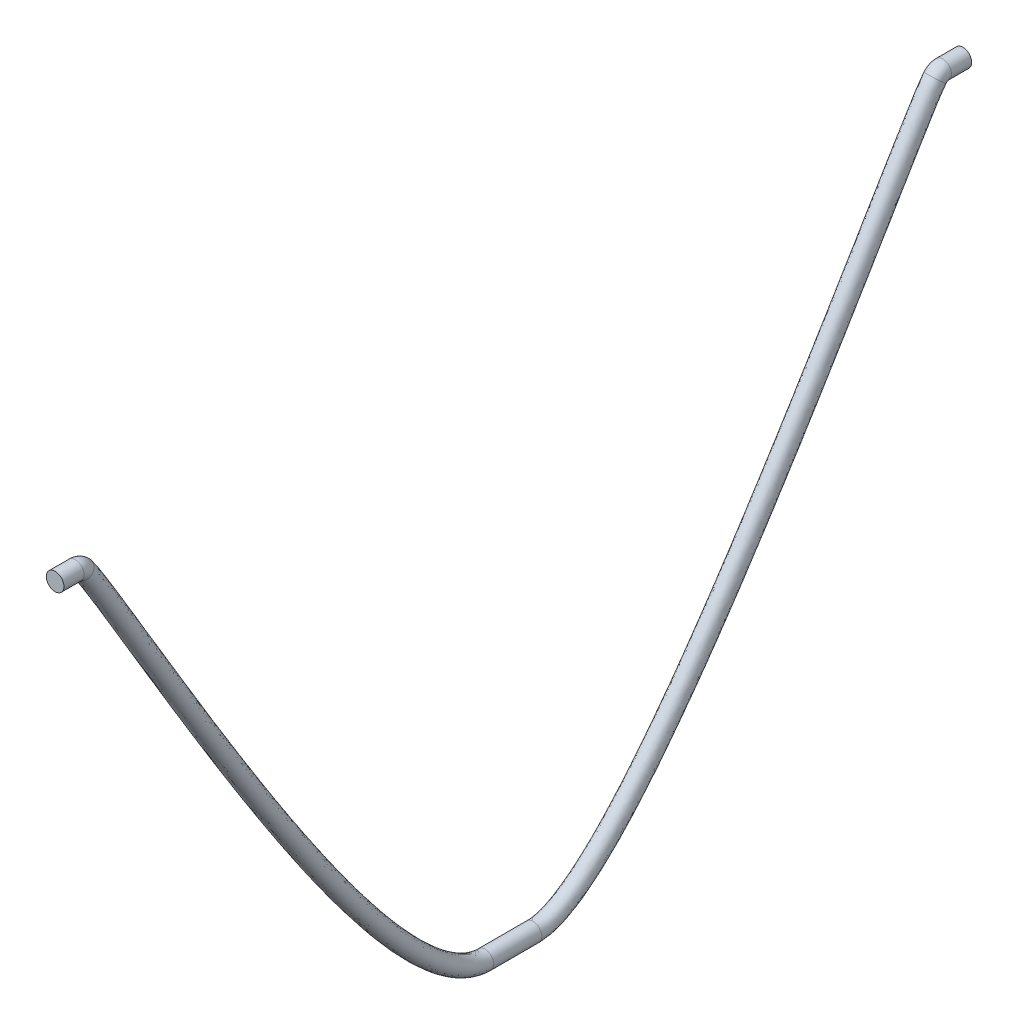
ISO-10303-21;
HEADER;
FILE_DESCRIPTION(('STEP AP214'),'2;1');
FILE_NAME('part.step','',(''),(''),'','','');
FILE_SCHEMA(('AUTOMOTIVE_DESIGN { 1 0 10303 214 1 1 1 1 }'));
ENDSEC;
DATA;
#1=APPLICATION_CONTEXT('core data for automotive mechanical design processes');
#2=APPLICATION_PROTOCOL_DEFINITION('international standard','automotive_design',2000,#1);
#3=PRODUCT_CONTEXT('',#1,'mechanical');
#4=PRODUCT('Part','Part','',(#3));
#5=PRODUCT_RELATED_PRODUCT_CATEGORY('part','',(#4));
#6=PRODUCT_DEFINITION_FORMATION('','',#4);
#7=PRODUCT_DEFINITION_CONTEXT('part definition',#1,'design');
#8=PRODUCT_DEFINITION('design','',#6,#7);
#9=PRODUCT_DEFINITION_SHAPE('','',#8);
#10=(LENGTH_UNIT() NAMED_UNIT(*) SI_UNIT(.MILLI.,.METRE.));
#11=(NAMED_UNIT(*) PLANE_ANGLE_UNIT() SI_UNIT($,.RADIAN.));
#12=(NAMED_UNIT(*) SI_UNIT($,.STERADIAN.) SOLID_ANGLE_UNIT());
#13=UNCERTAINTY_MEASURE_WITH_UNIT(LENGTH_MEASURE(1.E-05),#10,'distance_accuracy_value','');
#14=(GEOMETRIC_REPRESENTATION_CONTEXT(3) GLOBAL_UNCERTAINTY_ASSIGNED_CONTEXT((#13)) GLOBAL_UNIT_ASSIGNED_CONTEXT((#10,
#11,#12)) REPRESENTATION_CONTEXT('',''));
#15=CARTESIAN_POINT('',(0.,0.,0.));
#16=DIRECTION('',(0.,0.,1.));
#17=DIRECTION('',(1.,0.,0.));
#18=AXIS2_PLACEMENT_3D('',#15,#16,#17);
#19=CARTESIAN_POINT('',(0.,174.954263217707,87.9676704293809));
#20=DIRECTION('',(0.,0.,1.));
#21=DIRECTION('',(0.,-1.,0.));
#22=AXIS2_PLACEMENT_3D('',#19,#20,#21);
#23=PLANE('',#22);
#24=CARTESIAN_POINT('',(0.,174.954263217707,87.9676704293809));
#25=DIRECTION('',(0.,0.,1.));
#26=DIRECTION('',(0.,-1.,0.));
#27=AXIS2_PLACEMENT_3D('',#24,#25,#26);
#28=CIRCLE('',#27,0.875);
#29=CARTESIAN_POINT('',(0.,174.079263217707,87.9676704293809));
#30=VERTEX_POINT('',#29);
#31=EDGE_CURVE('E48',#30,#30,#28,.T.);
#32=ORIENTED_EDGE('',*,*,#31,.F.);
#33=EDGE_LOOP('',(#32));
#34=FACE_BOUND('',#33,.T.);
#35=ADVANCED_FACE('F36',(#34),#23,.F.);
#36=CARTESIAN_POINT('',(0.,174.954263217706,177.967670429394));
#37=DIRECTION('',(0.,0.,1.));
#38=DIRECTION('',(0.,-1.,0.));
#39=AXIS2_PLACEMENT_3D('',#36,#37,#38);
#40=PLANE('',#39);
#41=CARTESIAN_POINT('',(0.,174.954263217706,177.967670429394));
#42=DIRECTION('',(0.,0.,1.));
#43=DIRECTION('',(0.,-1.,0.));
#44=AXIS2_PLACEMENT_3D('',#41,#42,#43);
#45=CIRCLE('',#44,0.875);
#46=CARTESIAN_POINT('',(0.,174.079263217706,177.967670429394));
#47=VERTEX_POINT('',#46);
#48=EDGE_CURVE('E11',#47,#47,#45,.T.);
#49=ORIENTED_EDGE('',*,*,#48,.T.);
#50=EDGE_LOOP('',(#49));
#51=FACE_BOUND('',#50,.T.);
#52=ADVANCED_FACE('F51',(#51),#40,.T.);
#53=CARTESIAN_POINT('',(0.,174.954263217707,87.9676704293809));
#54=DIRECTION('',(0.,0.,1.));
#55=DIRECTION('',(1.,0.,0.));
#56=AXIS2_PLACEMENT_3D('',#53,#54,#55);
#57=CYLINDRICAL_SURFACE('',#56,0.875);
#58=CARTESIAN_POINT('',(0.,174.954263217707,89.9695399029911));
#59=DIRECTION('',(0.,0.,1.));
#60=DIRECTION('',(0.,-1.,0.));
#61=AXIS2_PLACEMENT_3D('',#58,#59,#60);
#62=CIRCLE('',#61,0.875);
#63=CARTESIAN_POINT('',(0.,175.829263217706,89.9695399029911));
#64=VERTEX_POINT('',#63);
#65=EDGE_CURVE('E74',#64,#64,#62,.T.);
#66=ORIENTED_EDGE('',*,*,#65,.F.);
#67=EDGE_LOOP('',(#66));
#68=FACE_BOUND('',#67,.T.);
#69=ORIENTED_EDGE('',*,*,#31,.T.);
#70=EDGE_LOOP('',(#69));
#71=FACE_BOUND('',#70,.T.);
#72=ADVANCED_FACE('F78',(#68,#71),#57,.T.);
#73=CARTESIAN_POINT('',(0.,173.954263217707,89.9695399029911));
#74=DIRECTION('',(1.,0.,0.));
#75=DIRECTION('',(0.,0.,-1.));
#76=AXIS2_PLACEMENT_3D('',#73,#74,#75);
#77=TOROIDAL_SURFACE('',#76,0.99999999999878,0.875);
#78=CARTESIAN_POINT('',(0.,174.60409439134,90.7296184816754));
#79=DIRECTION('',(0.,-0.760078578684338,0.649831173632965));
#80=DIRECTION('',(0.,-0.649831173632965,-0.760078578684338));
#81=AXIS2_PLACEMENT_3D('',#78,#79,#80);
#82=CIRCLE('',#81,0.875);
#83=CARTESIAN_POINT('',(0.,175.172696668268,91.3946872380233));
#84=VERTEX_POINT('',#83);
#85=EDGE_CURVE('E71',#84,#84,#82,.T.);
#86=CARTESIAN_POINT('',(0.,173.954263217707,89.9695399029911));
#87=DIRECTION('',(1.,0.,0.));
#88=DIRECTION('',(0.,0.,-1.));
#89=AXIS2_PLACEMENT_3D('',#86,#87,#88);
#90=CIRCLE('',#89,1.87499999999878);
#91=EDGE_CURVE('',#64,#84,#90,.T.);
#92=ORIENTED_EDGE('',*,*,#65,.T.);
#93=ORIENTED_EDGE('',*,*,#85,.F.);
#94=ORIENTED_EDGE('',*,*,#91,.T.);
#95=ORIENTED_EDGE('',*,*,#91,.F.);
#96=EDGE_LOOP('',(#92,#94,#93,#95));
#97=FACE_BOUND('',#96,.T.);
#98=ADVANCED_FACE('F80',(#97),#77,.T.);
#99=CARTESIAN_POINT('',(0.,174.035492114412,90.0645497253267));
#100=CARTESIAN_POINT('',(0.,173.984936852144,90.107772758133));
#101=CARTESIAN_POINT('',(0.,173.713864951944,90.3042240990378));
#102=CARTESIAN_POINT('',(0.,172.993263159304,90.7749549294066));
#103=CARTESIAN_POINT('',(0.,172.523548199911,91.0705557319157));
#104=CARTESIAN_POINT('',(0.,170.892412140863,92.0781385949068));
#105=CARTESIAN_POINT('',(0.,169.517897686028,92.9062457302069));
#106=CARTESIAN_POINT('',(0.,166.51989576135,94.7023366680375));
#107=CARTESIAN_POINT('',(0.,164.902947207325,95.6662973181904));
#108=CARTESIAN_POINT('',(0.,161.64619281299,97.6122545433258));
#109=CARTESIAN_POINT('',(0.,160.00732353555,98.5936192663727));
#110=CARTESIAN_POINT('',(0.,155.467168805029,101.330040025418));
#111=CARTESIAN_POINT('',(0.,152.700493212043,103.020228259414));
#112=CARTESIAN_POINT('',(0.,147.597206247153,106.199019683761));
#113=CARTESIAN_POINT('',(0.,145.253830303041,107.691235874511));
#114=CARTESIAN_POINT('',(0.,138.785530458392,111.918158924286));
#115=CARTESIAN_POINT('',(0.,135.202534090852,114.409284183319));
#116=CARTESIAN_POINT('',(0.,128.998558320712,119.119218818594));
#117=CARTESIAN_POINT('',(0.,126.344874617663,121.347264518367));
#118=CARTESIAN_POINT('',(0.,123.154494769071,124.721001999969));
#119=CARTESIAN_POINT('',(0.,122.231870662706,125.843628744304));
#120=CARTESIAN_POINT('',(0.,121.179141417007,127.574020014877));
#121=CARTESIAN_POINT('',(0.,120.885737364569,128.157060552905));
#122=CARTESIAN_POINT('',(0.,120.568736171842,129.050041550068));
#123=CARTESIAN_POINT('',(0.,120.483726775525,129.350979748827));
#124=CARTESIAN_POINT('',(0.,120.394959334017,129.808925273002));
#125=CARTESIAN_POINT('',(0.,120.371862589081,129.96266003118));
#126=CARTESIAN_POINT('',(0.,120.340396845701,130.272277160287));
#127=CARTESIAN_POINT('',(0.,120.332032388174,130.443747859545));
#128=CARTESIAN_POINT('',(0.,120.332032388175,130.584878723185));
#129=CARTESIAN_POINT('',(1.75,174.035492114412,90.0645497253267));
#130=CARTESIAN_POINT('',(1.75,173.984936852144,90.107772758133));
#131=CARTESIAN_POINT('',(1.75,173.713864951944,90.3042240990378));
#132=CARTESIAN_POINT('',(1.75,172.993263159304,90.7749549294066));
#133=CARTESIAN_POINT('',(1.75,172.523548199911,91.0705557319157));
#134=CARTESIAN_POINT('',(1.75,170.892412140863,92.0781385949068));
#135=CARTESIAN_POINT('',(1.75,169.517897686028,92.9062457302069));
#136=CARTESIAN_POINT('',(1.75,166.51989576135,94.7023366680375));
#137=CARTESIAN_POINT('',(1.75,164.902947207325,95.6662973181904));
#138=CARTESIAN_POINT('',(1.75,161.64619281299,97.6122545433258));
#139=CARTESIAN_POINT('',(1.75,160.00732353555,98.5936192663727));
#140=CARTESIAN_POINT('',(1.75,155.467168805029,101.330040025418));
#141=CARTESIAN_POINT('',(1.75,152.700493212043,103.020228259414));
#142=CARTESIAN_POINT('',(1.75,147.597206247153,106.199019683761));
#143=CARTESIAN_POINT('',(1.75,145.253830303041,107.691235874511));
#144=CARTESIAN_POINT('',(1.75,138.785530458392,111.918158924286));
#145=CARTESIAN_POINT('',(1.75,135.202534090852,114.409284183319));
#146=CARTESIAN_POINT('',(1.75,128.998558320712,119.119218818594));
#147=CARTESIAN_POINT('',(1.75,126.344874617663,121.347264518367));
#148=CARTESIAN_POINT('',(1.75,123.154494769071,124.721001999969));
#149=CARTESIAN_POINT('',(1.75,122.231870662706,125.843628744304));
#150=CARTESIAN_POINT('',(1.75,121.179141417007,127.574020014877));
#151=CARTESIAN_POINT('',(1.75,120.885737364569,128.157060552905));
#152=CARTESIAN_POINT('',(1.75,120.568736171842,129.050041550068));
#153=CARTESIAN_POINT('',(1.75,120.483726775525,129.350979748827));
#154=CARTESIAN_POINT('',(1.75,120.394959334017,129.808925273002));
#155=CARTESIAN_POINT('',(1.75,120.371862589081,129.96266003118));
#156=CARTESIAN_POINT('',(1.75,120.340396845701,130.272277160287));
#157=CARTESIAN_POINT('',(1.75,120.332032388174,130.443747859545));
#158=CARTESIAN_POINT('',(1.75,120.332032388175,130.584878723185));
#159=CARTESIAN_POINT('',(1.75,175.172696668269,91.3946872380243));
#160=CARTESIAN_POINT('',(1.75,174.956223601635,91.5797606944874));
#161=CARTESIAN_POINT('',(1.75,174.692106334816,91.7554936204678));
#162=CARTESIAN_POINT('',(1.75,173.929164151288,92.2538831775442));
#163=CARTESIAN_POINT('',(1.75,173.450355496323,92.5550078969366));
#164=CARTESIAN_POINT('',(1.75,171.797866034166,93.5757811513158));
#165=CARTESIAN_POINT('',(1.75,170.419747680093,94.4059706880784));
#166=CARTESIAN_POINT('',(1.75,167.416784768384,96.2050337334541));
#167=CARTESIAN_POINT('',(1.75,165.799696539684,97.1690753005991));
#168=CARTESIAN_POINT('',(1.75,162.544684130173,99.1139916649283));
#169=CARTESIAN_POINT('',(1.75,160.907800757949,100.094169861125));
#170=CARTESIAN_POINT('',(1.75,156.375921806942,102.825602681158));
#171=CARTESIAN_POINT('',(1.75,153.616697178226,104.511262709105));
#172=CARTESIAN_POINT('',(1.75,148.531490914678,107.678791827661));
#173=CARTESIAN_POINT('',(1.75,146.198772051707,109.164261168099));
#174=CARTESIAN_POINT('',(1.75,139.767587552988,113.366929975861));
#175=CARTESIAN_POINT('',(1.75,136.215326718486,115.837568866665));
#176=CARTESIAN_POINT('',(1.75,130.102107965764,120.478602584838));
#177=CARTESIAN_POINT('',(1.75,127.504980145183,122.667470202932));
#178=CARTESIAN_POINT('',(1.75,124.481701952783,125.864502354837));
#179=CARTESIAN_POINT('',(1.75,123.630791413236,126.911212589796));
#180=CARTESIAN_POINT('',(1.75,122.722270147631,128.404566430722));
#181=CARTESIAN_POINT('',(1.75,122.483709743,128.886720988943));
#182=CARTESIAN_POINT('',(1.75,122.243503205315,129.563374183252));
#183=CARTESIAN_POINT('',(1.75,122.182928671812,129.781088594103));
#184=CARTESIAN_POINT('',(1.75,122.122390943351,130.093398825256));
#185=CARTESIAN_POINT('',(1.75,122.107250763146,130.195133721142));
#186=CARTESIAN_POINT('',(1.75,122.087073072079,130.393678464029));
#187=CARTESIAN_POINT('',(1.75,122.082032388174,130.47490536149));
#188=CARTESIAN_POINT('',(1.75,122.082032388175,130.584878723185));
#189=CARTESIAN_POINT('',(0.,175.172696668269,91.3946872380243));
#190=CARTESIAN_POINT('',(0.,174.956223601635,91.5797606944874));
#191=CARTESIAN_POINT('',(0.,174.692106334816,91.7554936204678));
#192=CARTESIAN_POINT('',(0.,173.929164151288,92.2538831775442));
#193=CARTESIAN_POINT('',(0.,173.450355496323,92.5550078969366));
#194=CARTESIAN_POINT('',(0.,171.797866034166,93.5757811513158));
#195=CARTESIAN_POINT('',(0.,170.419747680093,94.4059706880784));
#196=CARTESIAN_POINT('',(0.,167.416784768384,96.2050337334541));
#197=CARTESIAN_POINT('',(0.,165.799696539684,97.1690753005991));
#198=CARTESIAN_POINT('',(0.,162.544684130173,99.1139916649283));
#199=CARTESIAN_POINT('',(0.,160.907800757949,100.094169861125));
#200=CARTESIAN_POINT('',(0.,156.375921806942,102.825602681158));
#201=CARTESIAN_POINT('',(0.,153.616697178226,104.511262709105));
#202=CARTESIAN_POINT('',(0.,148.531490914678,107.678791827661));
#203=CARTESIAN_POINT('',(0.,146.198772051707,109.164261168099));
#204=CARTESIAN_POINT('',(0.,139.767587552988,113.366929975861));
#205=CARTESIAN_POINT('',(0.,136.215326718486,115.837568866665));
#206=CARTESIAN_POINT('',(0.,130.102107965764,120.478602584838));
#207=CARTESIAN_POINT('',(0.,127.504980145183,122.667470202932));
#208=CARTESIAN_POINT('',(0.,124.481701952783,125.864502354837));
#209=CARTESIAN_POINT('',(0.,123.630791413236,126.911212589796));
#210=CARTESIAN_POINT('',(0.,122.722270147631,128.404566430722));
#211=CARTESIAN_POINT('',(0.,122.483709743,128.886720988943));
#212=CARTESIAN_POINT('',(0.,122.243503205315,129.563374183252));
#213=CARTESIAN_POINT('',(0.,122.182928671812,129.781088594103));
#214=CARTESIAN_POINT('',(0.,122.122390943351,130.093398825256));
#215=CARTESIAN_POINT('',(0.,122.107250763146,130.195133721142));
#216=CARTESIAN_POINT('',(0.,122.087073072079,130.393678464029));
#217=CARTESIAN_POINT('',(0.,122.082032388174,130.47490536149));
#218=CARTESIAN_POINT('',(0.,122.082032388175,130.584878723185));
#219=CARTESIAN_POINT('',(-1.75,175.172696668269,91.3946872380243));
#220=CARTESIAN_POINT('',(-1.75,174.956223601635,91.5797606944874));
#221=CARTESIAN_POINT('',(-1.75,174.692106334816,91.7554936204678));
#222=CARTESIAN_POINT('',(-1.75,173.929164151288,92.2538831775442));
#223=CARTESIAN_POINT('',(-1.75,173.450355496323,92.5550078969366));
#224=CARTESIAN_POINT('',(-1.75,171.797866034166,93.5757811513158));
#225=CARTESIAN_POINT('',(-1.75,170.419747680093,94.4059706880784));
#226=CARTESIAN_POINT('',(-1.75,167.416784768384,96.2050337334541));
#227=CARTESIAN_POINT('',(-1.75,165.799696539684,97.1690753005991));
#228=CARTESIAN_POINT('',(-1.75,162.544684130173,99.1139916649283));
#229=CARTESIAN_POINT('',(-1.75,160.907800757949,100.094169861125));
#230=CARTESIAN_POINT('',(-1.75,156.375921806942,102.825602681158));
#231=CARTESIAN_POINT('',(-1.75,153.616697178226,104.511262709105));
#232=CARTESIAN_POINT('',(-1.75,148.531490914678,107.678791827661));
#233=CARTESIAN_POINT('',(-1.75,146.198772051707,109.164261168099));
#234=CARTESIAN_POINT('',(-1.75,139.767587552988,113.366929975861));
#235=CARTESIAN_POINT('',(-1.75,136.215326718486,115.837568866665));
#236=CARTESIAN_POINT('',(-1.75,130.102107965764,120.478602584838));
#237=CARTESIAN_POINT('',(-1.75,127.504980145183,122.667470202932));
#238=CARTESIAN_POINT('',(-1.75,124.481701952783,125.864502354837));
#239=CARTESIAN_POINT('',(-1.75,123.630791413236,126.911212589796));
#240=CARTESIAN_POINT('',(-1.75,122.722270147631,128.404566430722));
#241=CARTESIAN_POINT('',(-1.75,122.483709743,128.886720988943));
#242=CARTESIAN_POINT('',(-1.75,122.243503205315,129.563374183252));
#243=CARTESIAN_POINT('',(-1.75,122.182928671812,129.781088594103));
#244=CARTESIAN_POINT('',(-1.75,122.122390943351,130.093398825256));
#245=CARTESIAN_POINT('',(-1.75,122.107250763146,130.195133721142));
#246=CARTESIAN_POINT('',(-1.75,122.087073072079,130.393678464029));
#247=CARTESIAN_POINT('',(-1.75,122.082032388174,130.47490536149));
#248=CARTESIAN_POINT('',(-1.75,122.082032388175,130.584878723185));
#249=CARTESIAN_POINT('',(-1.75,174.035492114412,90.0645497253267));
#250=CARTESIAN_POINT('',(-1.75,173.984936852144,90.107772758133));
#251=CARTESIAN_POINT('',(-1.75,173.713864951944,90.3042240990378));
#252=CARTESIAN_POINT('',(-1.75,172.993263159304,90.7749549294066));
#253=CARTESIAN_POINT('',(-1.75,172.523548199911,91.0705557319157));
#254=CARTESIAN_POINT('',(-1.75,170.892412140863,92.0781385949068));
#255=CARTESIAN_POINT('',(-1.75,169.517897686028,92.9062457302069));
#256=CARTESIAN_POINT('',(-1.75,166.51989576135,94.7023366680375));
#257=CARTESIAN_POINT('',(-1.75,164.902947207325,95.6662973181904));
#258=CARTESIAN_POINT('',(-1.75,161.64619281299,97.6122545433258));
#259=CARTESIAN_POINT('',(-1.75,160.00732353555,98.5936192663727));
#260=CARTESIAN_POINT('',(-1.75,155.467168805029,101.330040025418));
#261=CARTESIAN_POINT('',(-1.75,152.700493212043,103.020228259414));
#262=CARTESIAN_POINT('',(-1.75,147.597206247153,106.199019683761));
#263=CARTESIAN_POINT('',(-1.75,145.253830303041,107.691235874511));
#264=CARTESIAN_POINT('',(-1.75,138.785530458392,111.918158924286));
#265=CARTESIAN_POINT('',(-1.75,135.202534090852,114.409284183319));
#266=CARTESIAN_POINT('',(-1.75,128.998558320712,119.119218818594));
#267=CARTESIAN_POINT('',(-1.75,126.344874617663,121.347264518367));
#268=CARTESIAN_POINT('',(-1.75,123.154494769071,124.721001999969));
#269=CARTESIAN_POINT('',(-1.75,122.231870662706,125.843628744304));
#270=CARTESIAN_POINT('',(-1.75,121.179141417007,127.574020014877));
#271=CARTESIAN_POINT('',(-1.75,120.885737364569,128.157060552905));
#272=CARTESIAN_POINT('',(-1.75,120.568736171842,129.050041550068));
#273=CARTESIAN_POINT('',(-1.75,120.483726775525,129.350979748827));
#274=CARTESIAN_POINT('',(-1.75,120.394959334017,129.808925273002));
#275=CARTESIAN_POINT('',(-1.75,120.371862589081,129.96266003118));
#276=CARTESIAN_POINT('',(-1.75,120.340396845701,130.272277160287));
#277=CARTESIAN_POINT('',(-1.75,120.332032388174,130.443747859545));
#278=CARTESIAN_POINT('',(-1.75,120.332032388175,130.584878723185));
#279=CARTESIAN_POINT('',(0.,174.035492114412,90.0645497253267));
#280=CARTESIAN_POINT('',(0.,173.984936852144,90.107772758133));
#281=CARTESIAN_POINT('',(0.,173.713864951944,90.3042240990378));
#282=CARTESIAN_POINT('',(0.,172.993263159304,90.7749549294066));
#283=CARTESIAN_POINT('',(0.,172.523548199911,91.0705557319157));
#284=CARTESIAN_POINT('',(0.,170.892412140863,92.0781385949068));
#285=CARTESIAN_POINT('',(0.,169.517897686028,92.9062457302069));
#286=CARTESIAN_POINT('',(0.,166.51989576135,94.7023366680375));
#287=CARTESIAN_POINT('',(0.,164.902947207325,95.6662973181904));
#288=CARTESIAN_POINT('',(0.,161.64619281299,97.6122545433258));
#289=CARTESIAN_POINT('',(0.,160.00732353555,98.5936192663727));
#290=CARTESIAN_POINT('',(0.,155.467168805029,101.330040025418));
#291=CARTESIAN_POINT('',(0.,152.700493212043,103.020228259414));
#292=CARTESIAN_POINT('',(0.,147.597206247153,106.199019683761));
#293=CARTESIAN_POINT('',(0.,145.253830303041,107.691235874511));
#294=CARTESIAN_POINT('',(0.,138.785530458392,111.918158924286));
#295=CARTESIAN_POINT('',(0.,135.202534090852,114.409284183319));
#296=CARTESIAN_POINT('',(0.,128.998558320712,119.119218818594));
#297=CARTESIAN_POINT('',(0.,126.344874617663,121.347264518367));
#298=CARTESIAN_POINT('',(0.,123.154494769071,124.721001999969));
#299=CARTESIAN_POINT('',(0.,122.231870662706,125.843628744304));
#300=CARTESIAN_POINT('',(0.,121.179141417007,127.574020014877));
#301=CARTESIAN_POINT('',(0.,120.885737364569,128.157060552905));
#302=CARTESIAN_POINT('',(0.,120.568736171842,129.050041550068));
#303=CARTESIAN_POINT('',(0.,120.483726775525,129.350979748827));
#304=CARTESIAN_POINT('',(0.,120.394959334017,129.808925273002));
#305=CARTESIAN_POINT('',(0.,120.371862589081,129.96266003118));
#306=CARTESIAN_POINT('',(0.,120.340396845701,130.272277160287));
#307=CARTESIAN_POINT('',(0.,120.332032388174,130.443747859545));
#308=CARTESIAN_POINT('',(0.,120.332032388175,130.584878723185));
#309=(BOUNDED_SURFACE() B_SPLINE_SURFACE(3,3,((#99,#100,#101,#102,#103,#104,#105,#106,#107,#108,
#109,#110,#111,#112,#113,#114,#115,#116,#117,#118,#119,#120,#121,#122,#123,#124,#125,#126,#127,
#128),(#129,#130,#131,#132,#133,#134,#135,#136,#137,#138,#139,#140,#141,#142,#143,#144,#145,
#146,#147,#148,#149,#150,#151,#152,#153,#154,#155,#156,#157,#158),(#159,#160,#161,#162,#163,
#164,#165,#166,#167,#168,#169,#170,#171,#172,#173,#174,#175,#176,#177,#178,#179,#180,#181,#182,
#183,#184,#185,#186,#187,#188),(#189,#190,#191,#192,#193,#194,#195,#196,#197,#198,#199,#200,
#201,#202,#203,#204,#205,#206,#207,#208,#209,#210,#211,#212,#213,#214,#215,#216,#217,#218),
(#219,#220,#221,#222,#223,#224,#225,#226,#227,#228,#229,#230,#231,#232,#233,#234,#235,#236,#237,
#238,#239,#240,#241,#242,#243,#244,#245,#246,#247,#248),(#249,#250,#251,#252,#253,#254,#255,
#256,#257,#258,#259,#260,#261,#262,#263,#264,#265,#266,#267,#268,#269,#270,#271,#272,#273,#274,
#275,#276,#277,#278),(#279,#280,#281,#282,#283,#284,#285,#286,#287,#288,#289,#290,#291,#292,
#293,#294,#295,#296,#297,#298,#299,#300,#301,#302,#303,#304,#305,#306,#307,#308)),.UNSPECIFIED.,
.T.,.F.,.F.) B_SPLINE_SURFACE_WITH_KNOTS((4,3,4),(4,2,2,2,2,2,2,2,2,2,2,2,2,2,4),(0.,0.5,1.),
(0.019664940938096,0.0318871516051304,0.0441093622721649,0.0685537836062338,0.0929982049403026,
0.117442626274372,0.163215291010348,0.208987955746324,0.300533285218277,0.39207861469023,
0.437851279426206,0.460737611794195,0.472180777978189,0.477902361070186,0.483623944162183),
.UNSPECIFIED.) GEOMETRIC_REPRESENTATION_ITEM() RATIONAL_B_SPLINE_SURFACE(((1.,1.,1.,1.,1.,1.,1.,
1.,1.,1.,1.,1.,1.,1.,1.,1.,1.,1.,1.,1.,1.,1.,1.,1.,1.,1.,1.,1.,1.,1.),(0.333333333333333,
0.333333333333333,0.333333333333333,0.333333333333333,0.333333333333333,0.333333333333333,
0.333333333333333,0.333333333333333,0.333333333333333,0.333333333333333,0.333333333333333,
0.333333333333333,0.333333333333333,0.333333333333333,0.333333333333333,0.333333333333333,
0.333333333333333,0.333333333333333,0.333333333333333,0.333333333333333,0.333333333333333,
0.333333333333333,0.333333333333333,0.333333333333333,0.333333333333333,0.333333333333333,
0.333333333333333,0.333333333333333,0.333333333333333,0.333333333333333),(0.333333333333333,
0.333333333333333,0.333333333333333,0.333333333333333,0.333333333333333,0.333333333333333,
0.333333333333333,0.333333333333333,0.333333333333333,0.333333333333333,0.333333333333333,
0.333333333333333,0.333333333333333,0.333333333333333,0.333333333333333,0.333333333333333,
0.333333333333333,0.333333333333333,0.333333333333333,0.333333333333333,0.333333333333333,
0.333333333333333,0.333333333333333,0.333333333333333,0.333333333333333,0.333333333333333,
0.333333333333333,0.333333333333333,0.333333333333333,0.333333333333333),(1.,1.,1.,1.,1.,1.,1.,
1.,1.,1.,1.,1.,1.,1.,1.,1.,1.,1.,1.,1.,1.,1.,1.,1.,1.,1.,1.,1.,1.,1.),(0.333333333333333,
0.333333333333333,0.333333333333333,0.333333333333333,0.333333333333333,0.333333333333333,
0.333333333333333,0.333333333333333,0.333333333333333,0.333333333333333,0.333333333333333,
0.333333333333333,0.333333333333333,0.333333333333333,0.333333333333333,0.333333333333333,
0.333333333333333,0.333333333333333,0.333333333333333,0.333333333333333,0.333333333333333,
0.333333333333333,0.333333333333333,0.333333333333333,0.333333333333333,0.333333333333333,
0.333333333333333,0.333333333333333,0.333333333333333,0.333333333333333),(0.333333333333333,
0.333333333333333,0.333333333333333,0.333333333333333,0.333333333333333,0.333333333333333,
0.333333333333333,0.333333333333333,0.333333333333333,0.333333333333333,0.333333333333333,
0.333333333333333,0.333333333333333,0.333333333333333,0.333333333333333,0.333333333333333,
0.333333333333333,0.333333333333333,0.333333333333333,0.333333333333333,0.333333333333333,
0.333333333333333,0.333333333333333,0.333333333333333,0.333333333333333,0.333333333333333,
0.333333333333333,0.333333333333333,0.333333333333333,0.333333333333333),(1.,1.,1.,1.,1.,1.,1.,
1.,1.,1.,1.,1.,1.,1.,1.,1.,1.,1.,1.,1.,1.,1.,1.,1.,1.,1.,1.,1.,1.,1.))) REPRESENTATION_ITEM('') SURFACE());
#310=CARTESIAN_POINT('',(0.,121.207032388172,130.584878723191));
#311=DIRECTION('',(0.,0.,1.));
#312=DIRECTION('',(0.,-1.,0.));
#313=AXIS2_PLACEMENT_3D('',#310,#311,#312);
#314=CIRCLE('',#313,0.875);
#315=CARTESIAN_POINT('',(0.,120.332032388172,130.584878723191));
#316=VERTEX_POINT('',#315);
#317=EDGE_CURVE('E68',#316,#316,#314,.T.);
#318=ORIENTED_EDGE('',*,*,#317,.F.);
#319=EDGE_LOOP('',(#318));
#320=FACE_BOUND('',#319,.T.);
#321=ORIENTED_EDGE('',*,*,#85,.T.);
#322=EDGE_LOOP('',(#321));
#323=FACE_BOUND('',#322,.T.);
#324=ADVANCED_FACE('F87',(#320,#323),#309,.T.);
#325=CARTESIAN_POINT('',(0.,121.207032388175,130.584878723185));
#326=DIRECTION('',(0.,0.,1.));
#327=DIRECTION('',(1.,0.,0.));
#328=AXIS2_PLACEMENT_3D('',#325,#326,#327);
#329=CYLINDRICAL_SURFACE('',#328,0.875);
#330=CARTESIAN_POINT('',(0.,121.207032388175,135.350462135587));
#331=DIRECTION('',(0.,0.,1.));
#332=DIRECTION('',(0.,-1.,0.));
#333=AXIS2_PLACEMENT_3D('',#330,#331,#332);
#334=CIRCLE('',#333,0.875);
#335=CARTESIAN_POINT('',(0.,120.332032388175,135.350462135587));
#336=VERTEX_POINT('',#335);
#337=EDGE_CURVE('E63',#336,#336,#334,.T.);
#338=ORIENTED_EDGE('',*,*,#337,.F.);
#339=EDGE_LOOP('',(#338));
#340=FACE_BOUND('',#339,.T.);
#341=ORIENTED_EDGE('',*,*,#317,.T.);
#342=EDGE_LOOP('',(#341));
#343=FACE_BOUND('',#342,.T.);
#344=ADVANCED_FACE('F96',(#340,#343),#329,.T.);
#345=CARTESIAN_POINT('',(0.,120.332032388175,135.350462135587));
#346=CARTESIAN_POINT('',(0.,120.332032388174,135.491592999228));
#347=CARTESIAN_POINT('',(0.,120.340396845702,135.663063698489));
#348=CARTESIAN_POINT('',(0.,120.37186258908,135.972680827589));
#349=CARTESIAN_POINT('',(0.,120.39495933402,136.126415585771));
#350=CARTESIAN_POINT('',(0.,120.48372677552,136.584361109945));
#351=CARTESIAN_POINT('',(0.,120.568736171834,136.885299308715));
#352=CARTESIAN_POINT('',(0.,120.885737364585,137.778280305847));
#353=CARTESIAN_POINT('',(0.,121.179141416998,138.361320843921));
#354=CARTESIAN_POINT('',(0.,122.231870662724,140.091712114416));
#355=CARTESIAN_POINT('',(0.,123.154494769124,141.214338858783));
#356=CARTESIAN_POINT('',(0.,126.344874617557,144.588076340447));
#357=CARTESIAN_POINT('',(0.,128.998558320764,146.81612204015));
#358=CARTESIAN_POINT('',(0.,135.2025340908,151.526056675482));
#359=CARTESIAN_POINT('',(0.,138.785530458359,154.017181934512));
#360=CARTESIAN_POINT('',(0.,145.253830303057,158.244104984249));
#361=CARTESIAN_POINT('',(0.,147.597206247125,159.736321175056));
#362=CARTESIAN_POINT('',(0.,152.700493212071,162.915112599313));
#363=CARTESIAN_POINT('',(0.,155.467168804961,164.605300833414));
#364=CARTESIAN_POINT('',(0.,160.007323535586,167.341721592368));
#365=CARTESIAN_POINT('',(0.,161.64619281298,168.323086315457));
#366=CARTESIAN_POINT('',(0.,164.902947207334,170.269043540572));
#367=CARTESIAN_POINT('',(0.,166.519895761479,171.23300419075));
#368=CARTESIAN_POINT('',(0.,169.517897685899,173.029095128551));
#369=CARTESIAN_POINT('',(0.,170.892412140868,173.857202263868));
#370=CARTESIAN_POINT('',(0.,172.523548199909,174.864785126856));
#371=CARTESIAN_POINT('',(0.,172.993263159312,175.160385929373));
#372=CARTESIAN_POINT('',(0.,173.713864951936,175.631116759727));
#373=CARTESIAN_POINT('',(0.,173.984936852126,175.827568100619));
#374=CARTESIAN_POINT('',(0.,174.035492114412,175.870791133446));
#375=CARTESIAN_POINT('',(1.75,120.332032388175,135.350462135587));
#376=CARTESIAN_POINT('',(1.75,120.332032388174,135.491592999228));
#377=CARTESIAN_POINT('',(1.75,120.340396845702,135.663063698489));
#378=CARTESIAN_POINT('',(1.75,120.37186258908,135.972680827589));
#379=CARTESIAN_POINT('',(1.75,120.39495933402,136.126415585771));
#380=CARTESIAN_POINT('',(1.75,120.48372677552,136.584361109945));
#381=CARTESIAN_POINT('',(1.75,120.568736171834,136.885299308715));
#382=CARTESIAN_POINT('',(1.75,120.885737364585,137.778280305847));
#383=CARTESIAN_POINT('',(1.75,121.179141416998,138.361320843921));
#384=CARTESIAN_POINT('',(1.75,122.231870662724,140.091712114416));
#385=CARTESIAN_POINT('',(1.75,123.154494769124,141.214338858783));
#386=CARTESIAN_POINT('',(1.75,126.344874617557,144.588076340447));
#387=CARTESIAN_POINT('',(1.75,128.998558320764,146.81612204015));
#388=CARTESIAN_POINT('',(1.75,135.2025340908,151.526056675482));
#389=CARTESIAN_POINT('',(1.75,138.785530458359,154.017181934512));
#390=CARTESIAN_POINT('',(1.75,145.253830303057,158.244104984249));
#391=CARTESIAN_POINT('',(1.75,147.597206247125,159.736321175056));
#392=CARTESIAN_POINT('',(1.75,152.700493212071,162.915112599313));
#393=CARTESIAN_POINT('',(1.75,155.467168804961,164.605300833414));
#394=CARTESIAN_POINT('',(1.75,160.007323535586,167.341721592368));
#395=CARTESIAN_POINT('',(1.75,161.64619281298,168.323086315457));
#396=CARTESIAN_POINT('',(1.75,164.902947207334,170.269043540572));
#397=CARTESIAN_POINT('',(1.75,166.519895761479,171.23300419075));
#398=CARTESIAN_POINT('',(1.75,169.517897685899,173.029095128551));
#399=CARTESIAN_POINT('',(1.75,170.892412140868,173.857202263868));
#400=CARTESIAN_POINT('',(1.75,172.523548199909,174.864785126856));
#401=CARTESIAN_POINT('',(1.75,172.993263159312,175.160385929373));
#402=CARTESIAN_POINT('',(1.75,173.713864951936,175.631116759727));
#403=CARTESIAN_POINT('',(1.75,173.984936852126,175.827568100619));
#404=CARTESIAN_POINT('',(1.75,174.035492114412,175.870791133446));
#405=CARTESIAN_POINT('',(1.75,122.082032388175,135.350462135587));
#406=CARTESIAN_POINT('',(1.75,122.082032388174,135.460435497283));
#407=CARTESIAN_POINT('',(1.75,122.08707307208,135.541662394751));
#408=CARTESIAN_POINT('',(1.75,122.107250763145,135.740207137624));
#409=CARTESIAN_POINT('',(1.75,122.122390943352,135.841942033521));
#410=CARTESIAN_POINT('',(1.75,122.18292867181,136.154252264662));
#411=CARTESIAN_POINT('',(1.75,122.243503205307,136.371966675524));
#412=CARTESIAN_POINT('',(1.75,122.483709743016,137.048619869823));
#413=CARTESIAN_POINT('',(1.75,122.722270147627,137.530774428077));
#414=CARTESIAN_POINT('',(1.75,123.630791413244,139.024128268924));
#415=CARTESIAN_POINT('',(1.75,124.481701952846,140.070838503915));
#416=CARTESIAN_POINT('',(1.75,127.504980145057,143.267870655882));
#417=CARTESIAN_POINT('',(1.75,130.102107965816,145.456738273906));
#418=CARTESIAN_POINT('',(1.75,136.215326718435,150.097771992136));
#419=CARTESIAN_POINT('',(1.75,139.767587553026,152.568410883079));
#420=CARTESIAN_POINT('',(1.75,146.198772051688,156.771079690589));
#421=CARTESIAN_POINT('',(1.75,148.531490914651,158.256549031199));
#422=CARTESIAN_POINT('',(1.75,153.616697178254,161.424078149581));
#423=CARTESIAN_POINT('',(1.75,156.375921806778,163.109738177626));
#424=CARTESIAN_POINT('',(1.75,160.907800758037,165.841170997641));
#425=CARTESIAN_POINT('',(1.75,162.544684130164,166.821349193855));
#426=CARTESIAN_POINT('',(1.75,165.799696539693,168.766265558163));
#427=CARTESIAN_POINT('',(1.75,167.416784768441,169.730307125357));
#428=CARTESIAN_POINT('',(1.75,170.419747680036,171.529370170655));
#429=CARTESIAN_POINT('',(1.75,171.797866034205,172.359559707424));
#430=CARTESIAN_POINT('',(1.75,173.450355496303,173.380332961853));
#431=CARTESIAN_POINT('',(1.75,173.929164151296,173.681457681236));
#432=CARTESIAN_POINT('',(1.75,174.692106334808,174.179847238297));
#433=CARTESIAN_POINT('',(1.75,174.956223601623,174.355580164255));
#434=CARTESIAN_POINT('',(1.75,175.172696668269,174.540653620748));
#435=CARTESIAN_POINT('',(0.,122.082032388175,135.350462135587));
#436=CARTESIAN_POINT('',(0.,122.082032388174,135.460435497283));
#437=CARTESIAN_POINT('',(0.,122.08707307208,135.541662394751));
#438=CARTESIAN_POINT('',(0.,122.107250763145,135.740207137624));
#439=CARTESIAN_POINT('',(0.,122.122390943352,135.841942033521));
#440=CARTESIAN_POINT('',(0.,122.18292867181,136.154252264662));
#441=CARTESIAN_POINT('',(0.,122.243503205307,136.371966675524));
#442=CARTESIAN_POINT('',(0.,122.483709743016,137.048619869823));
#443=CARTESIAN_POINT('',(0.,122.722270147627,137.530774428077));
#444=CARTESIAN_POINT('',(0.,123.630791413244,139.024128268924));
#445=CARTESIAN_POINT('',(0.,124.481701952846,140.070838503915));
#446=CARTESIAN_POINT('',(0.,127.504980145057,143.267870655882));
#447=CARTESIAN_POINT('',(0.,130.102107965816,145.456738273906));
#448=CARTESIAN_POINT('',(0.,136.215326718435,150.097771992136));
#449=CARTESIAN_POINT('',(0.,139.767587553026,152.568410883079));
#450=CARTESIAN_POINT('',(0.,146.198772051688,156.771079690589));
#451=CARTESIAN_POINT('',(0.,148.531490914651,158.256549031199));
#452=CARTESIAN_POINT('',(0.,153.616697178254,161.424078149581));
#453=CARTESIAN_POINT('',(0.,156.375921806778,163.109738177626));
#454=CARTESIAN_POINT('',(0.,160.907800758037,165.841170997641));
#455=CARTESIAN_POINT('',(0.,162.544684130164,166.821349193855));
#456=CARTESIAN_POINT('',(0.,165.799696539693,168.766265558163));
#457=CARTESIAN_POINT('',(0.,167.416784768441,169.730307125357));
#458=CARTESIAN_POINT('',(0.,170.419747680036,171.529370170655));
#459=CARTESIAN_POINT('',(0.,171.797866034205,172.359559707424));
#460=CARTESIAN_POINT('',(0.,173.450355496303,173.380332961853));
#461=CARTESIAN_POINT('',(0.,173.929164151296,173.681457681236));
#462=CARTESIAN_POINT('',(0.,174.692106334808,174.179847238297));
#463=CARTESIAN_POINT('',(0.,174.956223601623,174.355580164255));
#464=CARTESIAN_POINT('',(0.,175.172696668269,174.540653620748));
#465=CARTESIAN_POINT('',(-1.75,122.082032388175,135.350462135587));
#466=CARTESIAN_POINT('',(-1.75,122.082032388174,135.460435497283));
#467=CARTESIAN_POINT('',(-1.75,122.08707307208,135.541662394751));
#468=CARTESIAN_POINT('',(-1.75,122.107250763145,135.740207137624));
#469=CARTESIAN_POINT('',(-1.75,122.122390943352,135.841942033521));
#470=CARTESIAN_POINT('',(-1.75,122.18292867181,136.154252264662));
#471=CARTESIAN_POINT('',(-1.75,122.243503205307,136.371966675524));
#472=CARTESIAN_POINT('',(-1.75,122.483709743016,137.048619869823));
#473=CARTESIAN_POINT('',(-1.75,122.722270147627,137.530774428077));
#474=CARTESIAN_POINT('',(-1.75,123.630791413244,139.024128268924));
#475=CARTESIAN_POINT('',(-1.75,124.481701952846,140.070838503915));
#476=CARTESIAN_POINT('',(-1.75,127.504980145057,143.267870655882));
#477=CARTESIAN_POINT('',(-1.75,130.102107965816,145.456738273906));
#478=CARTESIAN_POINT('',(-1.75,136.215326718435,150.097771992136));
#479=CARTESIAN_POINT('',(-1.75,139.767587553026,152.568410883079));
#480=CARTESIAN_POINT('',(-1.75,146.198772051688,156.771079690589));
#481=CARTESIAN_POINT('',(-1.75,148.531490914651,158.256549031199));
#482=CARTESIAN_POINT('',(-1.75,153.616697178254,161.424078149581));
#483=CARTESIAN_POINT('',(-1.75,156.375921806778,163.109738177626));
#484=CARTESIAN_POINT('',(-1.75,160.907800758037,165.841170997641));
#485=CARTESIAN_POINT('',(-1.75,162.544684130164,166.821349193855));
#486=CARTESIAN_POINT('',(-1.75,165.799696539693,168.766265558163));
#487=CARTESIAN_POINT('',(-1.75,167.416784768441,169.730307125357));
#488=CARTESIAN_POINT('',(-1.75,170.419747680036,171.529370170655));
#489=CARTESIAN_POINT('',(-1.75,171.797866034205,172.359559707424));
#490=CARTESIAN_POINT('',(-1.75,173.450355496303,173.380332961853));
#491=CARTESIAN_POINT('',(-1.75,173.929164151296,173.681457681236));
#492=CARTESIAN_POINT('',(-1.75,174.692106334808,174.179847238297));
#493=CARTESIAN_POINT('',(-1.75,174.956223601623,174.355580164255));
#494=CARTESIAN_POINT('',(-1.75,175.172696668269,174.540653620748));
#495=CARTESIAN_POINT('',(-1.75,120.332032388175,135.350462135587));
#496=CARTESIAN_POINT('',(-1.75,120.332032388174,135.491592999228));
#497=CARTESIAN_POINT('',(-1.75,120.340396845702,135.663063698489));
#498=CARTESIAN_POINT('',(-1.75,120.37186258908,135.972680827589));
#499=CARTESIAN_POINT('',(-1.75,120.39495933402,136.126415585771));
#500=CARTESIAN_POINT('',(-1.75,120.48372677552,136.584361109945));
#501=CARTESIAN_POINT('',(-1.75,120.568736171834,136.885299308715));
#502=CARTESIAN_POINT('',(-1.75,120.885737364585,137.778280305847));
#503=CARTESIAN_POINT('',(-1.75,121.179141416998,138.361320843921));
#504=CARTESIAN_POINT('',(-1.75,122.231870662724,140.091712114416));
#505=CARTESIAN_POINT('',(-1.75,123.154494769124,141.214338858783));
#506=CARTESIAN_POINT('',(-1.75,126.344874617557,144.588076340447));
#507=CARTESIAN_POINT('',(-1.75,128.998558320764,146.81612204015));
#508=CARTESIAN_POINT('',(-1.75,135.2025340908,151.526056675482));
#509=CARTESIAN_POINT('',(-1.75,138.785530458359,154.017181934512));
#510=CARTESIAN_POINT('',(-1.75,145.253830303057,158.244104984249));
#511=CARTESIAN_POINT('',(-1.75,147.597206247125,159.736321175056));
#512=CARTESIAN_POINT('',(-1.75,152.700493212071,162.915112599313));
#513=CARTESIAN_POINT('',(-1.75,155.467168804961,164.605300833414));
#514=CARTESIAN_POINT('',(-1.75,160.007323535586,167.341721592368));
#515=CARTESIAN_POINT('',(-1.75,161.64619281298,168.323086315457));
#516=CARTESIAN_POINT('',(-1.75,164.902947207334,170.269043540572));
#517=CARTESIAN_POINT('',(-1.75,166.519895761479,171.23300419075));
#518=CARTESIAN_POINT('',(-1.75,169.517897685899,173.029095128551));
#519=CARTESIAN_POINT('',(-1.75,170.892412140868,173.857202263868));
#520=CARTESIAN_POINT('',(-1.75,172.523548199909,174.864785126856));
#521=CARTESIAN_POINT('',(-1.75,172.993263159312,175.160385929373));
#522=CARTESIAN_POINT('',(-1.75,173.713864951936,175.631116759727));
#523=CARTESIAN_POINT('',(-1.75,173.984936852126,175.827568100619));
#524=CARTESIAN_POINT('',(-1.75,174.035492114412,175.870791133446));
#525=CARTESIAN_POINT('',(0.,120.332032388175,135.350462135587));
#526=CARTESIAN_POINT('',(0.,120.332032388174,135.491592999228));
#527=CARTESIAN_POINT('',(0.,120.340396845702,135.663063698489));
#528=CARTESIAN_POINT('',(0.,120.37186258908,135.972680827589));
#529=CARTESIAN_POINT('',(0.,120.39495933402,136.126415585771));
#530=CARTESIAN_POINT('',(0.,120.48372677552,136.584361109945));
#531=CARTESIAN_POINT('',(0.,120.568736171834,136.885299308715));
#532=CARTESIAN_POINT('',(0.,120.885737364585,137.778280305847));
#533=CARTESIAN_POINT('',(0.,121.179141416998,138.361320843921));
#534=CARTESIAN_POINT('',(0.,122.231870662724,140.091712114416));
#535=CARTESIAN_POINT('',(0.,123.154494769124,141.214338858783));
#536=CARTESIAN_POINT('',(0.,126.344874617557,144.588076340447));
#537=CARTESIAN_POINT('',(0.,128.998558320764,146.81612204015));
#538=CARTESIAN_POINT('',(0.,135.2025340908,151.526056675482));
#539=CARTESIAN_POINT('',(0.,138.785530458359,154.017181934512));
#540=CARTESIAN_POINT('',(0.,145.253830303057,158.244104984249));
#541=CARTESIAN_POINT('',(0.,147.597206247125,159.736321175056));
#542=CARTESIAN_POINT('',(0.,152.700493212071,162.915112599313));
#543=CARTESIAN_POINT('',(0.,155.467168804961,164.605300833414));
#544=CARTESIAN_POINT('',(0.,160.007323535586,167.341721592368));
#545=CARTESIAN_POINT('',(0.,161.64619281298,168.323086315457));
#546=CARTESIAN_POINT('',(0.,164.902947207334,170.269043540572));
#547=CARTESIAN_POINT('',(0.,166.519895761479,171.23300419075));
#548=CARTESIAN_POINT('',(0.,169.517897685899,173.029095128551));
#549=CARTESIAN_POINT('',(0.,170.892412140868,173.857202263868));
#550=CARTESIAN_POINT('',(0.,172.523548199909,174.864785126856));
#551=CARTESIAN_POINT('',(0.,172.993263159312,175.160385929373));
#552=CARTESIAN_POINT('',(0.,173.713864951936,175.631116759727));
#553=CARTESIAN_POINT('',(0.,173.984936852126,175.827568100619));
#554=CARTESIAN_POINT('',(0.,174.035492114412,175.870791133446));
#555=(BOUNDED_SURFACE() B_SPLINE_SURFACE(3,3,((#345,#346,#347,#348,#349,#350,#351,#352,#353,
#354,#355,#356,#357,#358,#359,#360,#361,#362,#363,#364,#365,#366,#367,#368,#369,#370,#371,#372,
#373,#374),(#375,#376,#377,#378,#379,#380,#381,#382,#383,#384,#385,#386,#387,#388,#389,#390,
#391,#392,#393,#394,#395,#396,#397,#398,#399,#400,#401,#402,#403,#404),(#405,#406,#407,#408,
#409,#410,#411,#412,#413,#414,#415,#416,#417,#418,#419,#420,#421,#422,#423,#424,#425,#426,#427,
#428,#429,#430,#431,#432,#433,#434),(#435,#436,#437,#438,#439,#440,#441,#442,#443,#444,#445,
#446,#447,#448,#449,#450,#451,#452,#453,#454,#455,#456,#457,#458,#459,#460,#461,#462,#463,#464),
(#465,#466,#467,#468,#469,#470,#471,#472,#473,#474,#475,#476,#477,#478,#479,#480,#481,#482,#483,
#484,#485,#486,#487,#488,#489,#490,#491,#492,#493,#494),(#495,#496,#497,#498,#499,#500,#501,
#502,#503,#504,#505,#506,#507,#508,#509,#510,#511,#512,#513,#514,#515,#516,#517,#518,#519,#520,
#521,#522,#523,#524),(#525,#526,#527,#528,#529,#530,#531,#532,#533,#534,#535,#536,#537,#538,
#539,#540,#541,#542,#543,#544,#545,#546,#547,#548,#549,#550,#551,#552,#553,#554)),.UNSPECIFIED.,
.T.,.F.,.F.) B_SPLINE_SURFACE_WITH_KNOTS((4,3,4),(4,2,2,2,2,2,2,2,2,2,2,2,2,2,4),(0.,0.5,1.),
(0.516330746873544,0.52205288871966,0.527775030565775,0.539219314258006,0.562107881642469,
0.607885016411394,0.699439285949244,0.790993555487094,0.836770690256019,0.882547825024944,
0.906994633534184,0.931441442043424,0.955888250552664,0.968111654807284,0.980335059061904),
.UNSPECIFIED.) GEOMETRIC_REPRESENTATION_ITEM() RATIONAL_B_SPLINE_SURFACE(((1.,1.,1.,1.,1.,1.,1.,
1.,1.,1.,1.,1.,1.,1.,1.,1.,1.,1.,1.,1.,1.,1.,1.,1.,1.,1.,1.,1.,1.,1.),(0.333333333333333,
0.333333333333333,0.333333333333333,0.333333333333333,0.333333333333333,0.333333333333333,
0.333333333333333,0.333333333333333,0.333333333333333,0.333333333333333,0.333333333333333,
0.333333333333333,0.333333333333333,0.333333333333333,0.333333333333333,0.333333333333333,
0.333333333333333,0.333333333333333,0.333333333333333,0.333333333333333,0.333333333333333,
0.333333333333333,0.333333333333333,0.333333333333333,0.333333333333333,0.333333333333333,
0.333333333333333,0.333333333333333,0.333333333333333,0.333333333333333),(0.333333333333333,
0.333333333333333,0.333333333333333,0.333333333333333,0.333333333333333,0.333333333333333,
0.333333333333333,0.333333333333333,0.333333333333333,0.333333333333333,0.333333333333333,
0.333333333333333,0.333333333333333,0.333333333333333,0.333333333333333,0.333333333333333,
0.333333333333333,0.333333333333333,0.333333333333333,0.333333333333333,0.333333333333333,
0.333333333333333,0.333333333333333,0.333333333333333,0.333333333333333,0.333333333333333,
0.333333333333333,0.333333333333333,0.333333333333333,0.333333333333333),(1.,1.,1.,1.,1.,1.,1.,
1.,1.,1.,1.,1.,1.,1.,1.,1.,1.,1.,1.,1.,1.,1.,1.,1.,1.,1.,1.,1.,1.,1.),(0.333333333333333,
0.333333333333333,0.333333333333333,0.333333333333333,0.333333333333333,0.333333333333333,
0.333333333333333,0.333333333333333,0.333333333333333,0.333333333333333,0.333333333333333,
0.333333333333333,0.333333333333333,0.333333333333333,0.333333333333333,0.333333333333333,
0.333333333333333,0.333333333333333,0.333333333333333,0.333333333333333,0.333333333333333,
0.333333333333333,0.333333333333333,0.333333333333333,0.333333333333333,0.333333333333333,
0.333333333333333,0.333333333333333,0.333333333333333,0.333333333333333),(0.333333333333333,
0.333333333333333,0.333333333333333,0.333333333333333,0.333333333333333,0.333333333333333,
0.333333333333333,0.333333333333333,0.333333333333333,0.333333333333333,0.333333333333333,
0.333333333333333,0.333333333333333,0.333333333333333,0.333333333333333,0.333333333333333,
0.333333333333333,0.333333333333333,0.333333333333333,0.333333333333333,0.333333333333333,
0.333333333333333,0.333333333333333,0.333333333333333,0.333333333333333,0.333333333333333,
0.333333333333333,0.333333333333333,0.333333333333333,0.333333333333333),(1.,1.,1.,1.,1.,1.,1.,
1.,1.,1.,1.,1.,1.,1.,1.,1.,1.,1.,1.,1.,1.,1.,1.,1.,1.,1.,1.,1.,1.,1.))) REPRESENTATION_ITEM('') SURFACE());
#556=CARTESIAN_POINT('',(0.,174.60409439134,175.205722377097));
#557=DIRECTION('',(0.,0.760078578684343,0.649831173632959));
#558=DIRECTION('',(0.,-0.649831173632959,0.760078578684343));
#559=AXIS2_PLACEMENT_3D('',#556,#557,#558);
#560=CIRCLE('',#559,0.875);
#561=CARTESIAN_POINT('',(0.,175.172696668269,174.540653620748));
#562=VERTEX_POINT('',#561);
#563=EDGE_CURVE('E61',#562,#562,#560,.T.);
#564=ORIENTED_EDGE('',*,*,#563,.F.);
#565=EDGE_LOOP('',(#564));
#566=FACE_BOUND('',#565,.T.);
#567=ORIENTED_EDGE('',*,*,#337,.T.);
#568=EDGE_LOOP('',(#567));
#569=FACE_BOUND('',#568,.T.);
#570=ADVANCED_FACE('F105',(#566,#569),#555,.T.);
#571=CARTESIAN_POINT('',(0.,173.954263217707,175.965800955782));
#572=DIRECTION('',(1.,0.,0.));
#573=DIRECTION('',(0.,0.,-1.));
#574=AXIS2_PLACEMENT_3D('',#571,#572,#573);
#575=TOROIDAL_SURFACE('',#574,1.00000000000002,0.875);
#576=CARTESIAN_POINT('',(0.,174.954263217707,175.965800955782));
#577=DIRECTION('',(0.,0.,1.));
#578=DIRECTION('',(0.,-1.,0.));
#579=AXIS2_PLACEMENT_3D('',#576,#577,#578);
#580=CIRCLE('',#579,0.875);
#581=CARTESIAN_POINT('',(0.,175.829263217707,175.965800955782));
#582=VERTEX_POINT('',#581);
#583=EDGE_CURVE('E43',#582,#582,#580,.T.);
#584=CARTESIAN_POINT('',(0.,173.954263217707,175.965800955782));
#585=DIRECTION('',(1.,0.,0.));
#586=DIRECTION('',(0.,0.,-1.));
#587=AXIS2_PLACEMENT_3D('',#584,#585,#586);
#588=CIRCLE('',#587,1.87500000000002);
#589=EDGE_CURVE('',#562,#582,#588,.T.);
#590=ORIENTED_EDGE('',*,*,#563,.T.);
#591=ORIENTED_EDGE('',*,*,#583,.F.);
#592=ORIENTED_EDGE('',*,*,#589,.T.);
#593=ORIENTED_EDGE('',*,*,#589,.F.);
#594=EDGE_LOOP('',(#590,#592,#591,#593));
#595=FACE_BOUND('',#594,.T.);
#596=ADVANCED_FACE('F56',(#595),#575,.T.);
#597=CARTESIAN_POINT('',(0.,174.954263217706,175.965800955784));
#598=DIRECTION('',(0.,0.,1.));
#599=DIRECTION('',(0.,-1.,0.));
#600=AXIS2_PLACEMENT_3D('',#597,#598,#599);
#601=CYLINDRICAL_SURFACE('',#600,0.875);
#602=ORIENTED_EDGE('',*,*,#48,.F.);
#603=EDGE_LOOP('',(#602));
#604=FACE_BOUND('',#603,.T.);
#605=ORIENTED_EDGE('',*,*,#583,.T.);
#606=EDGE_LOOP('',(#605));
#607=FACE_BOUND('',#606,.T.);
#608=ADVANCED_FACE('F53',(#604,#607),#601,.T.);
#609=CLOSED_SHELL('',(#35,#52,#72,#98,#324,#344,#570,#596,#608));
#610=MANIFOLD_SOLID_BREP('B2',#609);
#611=ADVANCED_BREP_SHAPE_REPRESENTATION('',(#18,#610),#14);
#612=SHAPE_DEFINITION_REPRESENTATION(#9,#611);
ENDSEC;
END-ISO-10303-21;
